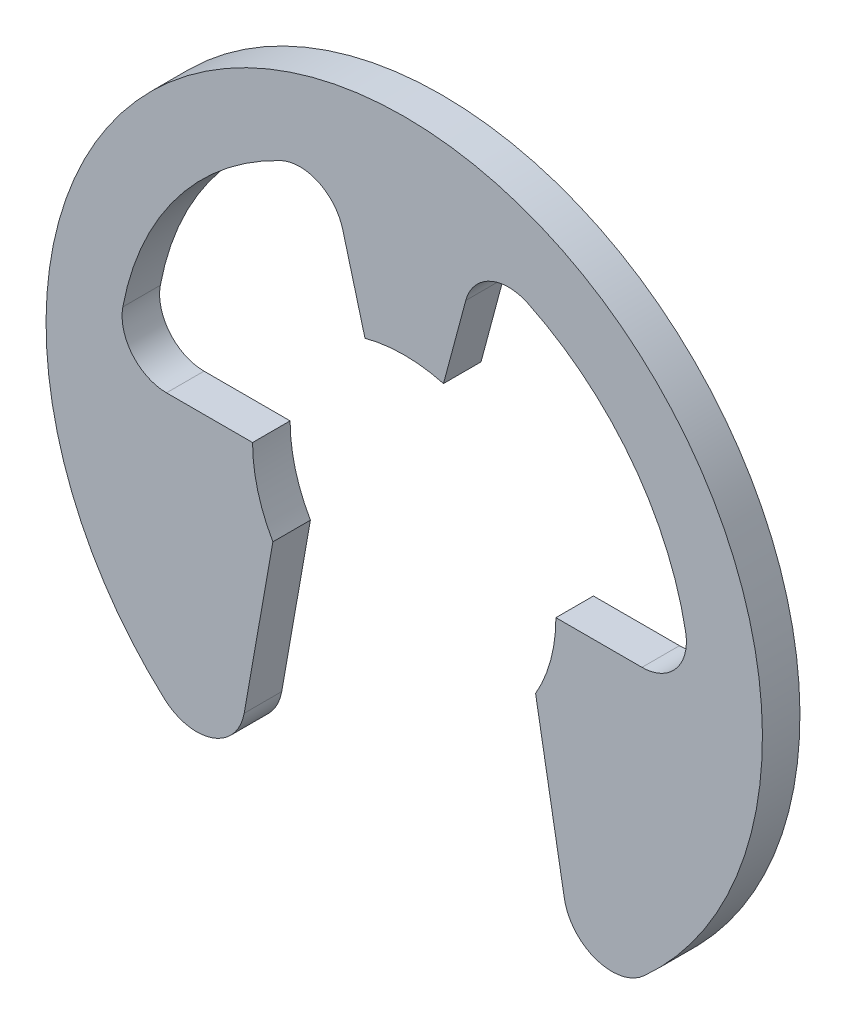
from build123d import *

# Parameters (mm, degrees)
BODY_DEPTH = 0.6


with BuildPart() as part:
    # BodySke → Body (new body)
    with BuildSketch(Plane.XY):
        with BuildLine():
            Line((2.100111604, -1.2125), (2.559190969, -3.816068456))
            ThreePointArc((2.559190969, -3.816068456), (3.06726901, -4.4108407), (3.833760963, -4.254676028))
            ThreePointArc((3.833760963, -4.254676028), (0, 5.72712766), (-3.833760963, -4.254676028))
            ThreePointArc((-3.833760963, -4.254676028), (-3.06726901, -4.4108407), (-2.559190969, -3.816068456))
            Line((-2.559190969, -3.816068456), (-2.100111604, -1.2125))
            ThreePointArc((-2.100111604, -1.2125), (-2.342370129, -0.627636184), (-2.425, 0))
            Line((-2.425, 0), (-3.801147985, 0))
            ThreePointArc((-3.801147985, 0), (-4.347510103, 0.256467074), (-4.499269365, 0.840638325))
            ThreePointArc((-4.499269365, 0.840638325), (-3.631279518, 2.786378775), (-1.976490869, 4.12838727))
            ThreePointArc((-1.976490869, 4.12838727), (-1.372946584, 4.132993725), (-0.983809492, 3.671627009))
            Line((-0.983809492, 3.671627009), (-0.627636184, 2.342370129))
            ThreePointArc((-0.627636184, 2.342370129), (0, 2.425), (0.627636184, 2.342370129))
            Line((0.627636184, 2.342370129), (0.983809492, 3.671627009))
            ThreePointArc((0.983809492, 3.671627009), (1.372946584, 4.132993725), (1.976490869, 4.12838727))
            ThreePointArc((1.976490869, 4.12838727), (3.631279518, 2.786378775), (4.499269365, 0.840638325))
            ThreePointArc((4.499269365, 0.840638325), (4.347510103, 0.256467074), (3.801147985, 0))
            Line((3.801147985, 0), (2.425, 0))
            ThreePointArc((2.425, 0), (2.342370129, -0.627636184), (2.100111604, -1.2125))
        make_face()
    extrude(amount=-BODY_DEPTH)


solid = part.part
